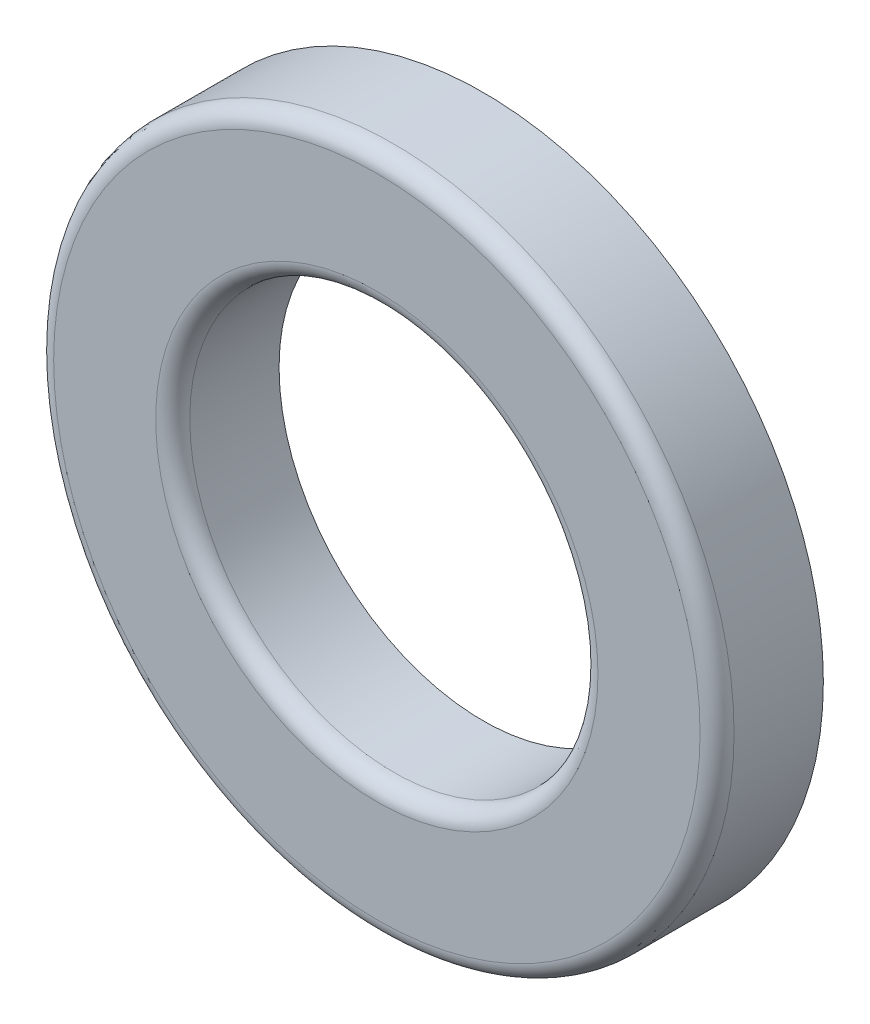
ISO-10303-21;
HEADER;
FILE_DESCRIPTION(('STEP AP214'),'2;1');
FILE_NAME('part.step','',(''),(''),'','','');
FILE_SCHEMA(('AUTOMOTIVE_DESIGN { 1 0 10303 214 1 1 1 1 }'));
ENDSEC;
DATA;
#1=APPLICATION_CONTEXT('core data for automotive mechanical design processes');
#2=APPLICATION_PROTOCOL_DEFINITION('international standard','automotive_design',2000,#1);
#3=PRODUCT_CONTEXT('',#1,'mechanical');
#4=PRODUCT('Part','Part','',(#3));
#5=PRODUCT_RELATED_PRODUCT_CATEGORY('part','',(#4));
#6=PRODUCT_DEFINITION_FORMATION('','',#4);
#7=PRODUCT_DEFINITION_CONTEXT('part definition',#1,'design');
#8=PRODUCT_DEFINITION('design','',#6,#7);
#9=PRODUCT_DEFINITION_SHAPE('','',#8);
#10=(LENGTH_UNIT() NAMED_UNIT(*) SI_UNIT(.MILLI.,.METRE.));
#11=(NAMED_UNIT(*) PLANE_ANGLE_UNIT() SI_UNIT($,.RADIAN.));
#12=(NAMED_UNIT(*) SI_UNIT($,.STERADIAN.) SOLID_ANGLE_UNIT());
#13=UNCERTAINTY_MEASURE_WITH_UNIT(LENGTH_MEASURE(1.E-05),#10,'distance_accuracy_value','');
#14=(GEOMETRIC_REPRESENTATION_CONTEXT(3) GLOBAL_UNCERTAINTY_ASSIGNED_CONTEXT((#13)) GLOBAL_UNIT_ASSIGNED_CONTEXT((#10,
#11,#12)) REPRESENTATION_CONTEXT('',''));
#15=CARTESIAN_POINT('',(0.,0.,0.));
#16=DIRECTION('',(0.,0.,1.));
#17=DIRECTION('',(1.,0.,0.));
#18=AXIS2_PLACEMENT_3D('',#15,#16,#17);
#19=CARTESIAN_POINT('',(0.,0.,0.79375));
#20=DIRECTION('',(0.,0.,1.));
#21=DIRECTION('',(1.,0.,0.));
#22=AXIS2_PLACEMENT_3D('',#19,#20,#21);
#23=PLANE('',#22);
#24=CARTESIAN_POINT('',(0.,0.,0.79375));
#25=DIRECTION('',(0.,0.,1.));
#26=DIRECTION('',(1.,0.,0.));
#27=AXIS2_PLACEMENT_3D('',#24,#25,#26);
#28=CIRCLE('',#27,1.651);
#29=CARTESIAN_POINT('',(1.651,0.,0.79375));
#30=VERTEX_POINT('',#29);
#31=EDGE_CURVE('E36',#30,#30,#28,.F.);
#32=ORIENTED_EDGE('',*,*,#31,.T.);
#33=EDGE_LOOP('',(#32));
#34=FACE_BOUND('',#33,.T.);
#35=CARTESIAN_POINT('',(0.,0.,0.79375));
#36=DIRECTION('',(0.,0.,1.));
#37=DIRECTION('',(1.,0.,0.));
#38=AXIS2_PLACEMENT_3D('',#35,#36,#37);
#39=CIRCLE('',#38,2.413);
#40=CARTESIAN_POINT('',(2.413,0.,0.79375));
#41=VERTEX_POINT('',#40);
#42=EDGE_CURVE('E40',#41,#41,#39,.T.);
#43=ORIENTED_EDGE('',*,*,#42,.T.);
#44=EDGE_LOOP('',(#43));
#45=FACE_BOUND('',#44,.T.);
#46=ADVANCED_FACE('F29',(#34,#45),#23,.T.);
#47=CARTESIAN_POINT('',(0.,0.,0.));
#48=DIRECTION('',(0.,0.,1.));
#49=DIRECTION('',(1.,0.,0.));
#50=AXIS2_PLACEMENT_3D('',#47,#48,#49);
#51=PLANE('',#50);
#52=CARTESIAN_POINT('',(0.,0.,0.));
#53=DIRECTION('',(0.,0.,1.));
#54=DIRECTION('',(1.,0.,0.));
#55=AXIS2_PLACEMENT_3D('',#52,#53,#54);
#56=CIRCLE('',#55,2.54);
#57=CARTESIAN_POINT('',(2.54,0.,0.));
#58=VERTEX_POINT('',#57);
#59=EDGE_CURVE('E49',#58,#58,#56,.T.);
#60=ORIENTED_EDGE('',*,*,#59,.F.);
#61=EDGE_LOOP('',(#60));
#62=FACE_BOUND('',#61,.T.);
#63=CARTESIAN_POINT('',(0.,0.,0.));
#64=DIRECTION('',(0.,0.,1.));
#65=DIRECTION('',(1.,0.,0.));
#66=AXIS2_PLACEMENT_3D('',#63,#64,#65);
#67=CIRCLE('',#66,1.524);
#68=CARTESIAN_POINT('',(1.524,0.,0.));
#69=VERTEX_POINT('',#68);
#70=EDGE_CURVE('E52',#69,#69,#67,.T.);
#71=ORIENTED_EDGE('',*,*,#70,.T.);
#72=EDGE_LOOP('',(#71));
#73=FACE_BOUND('',#72,.T.);
#74=ADVANCED_FACE('F56',(#62,#73),#51,.F.);
#75=CARTESIAN_POINT('',(0.,0.,0.79375));
#76=DIRECTION('',(0.,0.,-1.));
#77=DIRECTION('',(-1.,0.,0.));
#78=AXIS2_PLACEMENT_3D('',#75,#76,#77);
#79=CYLINDRICAL_SURFACE('',#78,2.54);
#80=CARTESIAN_POINT('',(0.,0.,0.66675));
#81=DIRECTION('',(0.,0.,1.));
#82=DIRECTION('',(1.,0.,0.));
#83=AXIS2_PLACEMENT_3D('',#80,#81,#82);
#84=CIRCLE('',#83,2.54);
#85=CARTESIAN_POINT('',(2.54,0.,0.66675));
#86=VERTEX_POINT('',#85);
#87=EDGE_CURVE('E10',#86,#86,#84,.F.);
#88=ORIENTED_EDGE('',*,*,#87,.T.);
#89=EDGE_LOOP('',(#88));
#90=FACE_BOUND('',#89,.T.);
#91=ORIENTED_EDGE('',*,*,#59,.T.);
#92=EDGE_LOOP('',(#91));
#93=FACE_BOUND('',#92,.T.);
#94=ADVANCED_FACE('F31',(#90,#93),#79,.T.);
#95=CARTESIAN_POINT('',(0.,0.,0.79375));
#96=DIRECTION('',(0.,0.,-1.));
#97=DIRECTION('',(-1.,0.,0.));
#98=AXIS2_PLACEMENT_3D('',#95,#96,#97);
#99=CYLINDRICAL_SURFACE('',#98,1.524);
#100=CARTESIAN_POINT('',(0.,0.,0.66675));
#101=DIRECTION('',(0.,0.,1.));
#102=DIRECTION('',(1.,0.,0.));
#103=AXIS2_PLACEMENT_3D('',#100,#101,#102);
#104=CIRCLE('',#103,1.524);
#105=CARTESIAN_POINT('',(1.524,0.,0.66675));
#106=VERTEX_POINT('',#105);
#107=EDGE_CURVE('E44',#106,#106,#104,.T.);
#108=ORIENTED_EDGE('',*,*,#107,.T.);
#109=EDGE_LOOP('',(#108));
#110=FACE_BOUND('',#109,.T.);
#111=ORIENTED_EDGE('',*,*,#70,.F.);
#112=EDGE_LOOP('',(#111));
#113=FACE_BOUND('',#112,.T.);
#114=ADVANCED_FACE('F58',(#110,#113),#99,.F.);
#115=CARTESIAN_POINT('',(0.,0.,0.66675));
#116=DIRECTION('',(0.,0.,1.));
#117=DIRECTION('',(1.,0.,0.));
#118=AXIS2_PLACEMENT_3D('',#115,#116,#117);
#119=TOROIDAL_SURFACE('',#118,1.651,0.127);
#120=ORIENTED_EDGE('',*,*,#31,.F.);
#121=EDGE_LOOP('',(#120));
#122=FACE_BOUND('',#121,.T.);
#123=ORIENTED_EDGE('',*,*,#107,.F.);
#124=EDGE_LOOP('',(#123));
#125=FACE_BOUND('',#124,.T.);
#126=ADVANCED_FACE('F60',(#122,#125),#119,.T.);
#127=CARTESIAN_POINT('',(0.,0.,0.66675));
#128=DIRECTION('',(0.,0.,1.));
#129=DIRECTION('',(1.,0.,0.));
#130=AXIS2_PLACEMENT_3D('',#127,#128,#129);
#131=TOROIDAL_SURFACE('',#130,2.413,0.127);
#132=ORIENTED_EDGE('',*,*,#87,.F.);
#133=EDGE_LOOP('',(#132));
#134=FACE_BOUND('',#133,.T.);
#135=ORIENTED_EDGE('',*,*,#42,.F.);
#136=EDGE_LOOP('',(#135));
#137=FACE_BOUND('',#136,.T.);
#138=ADVANCED_FACE('F67',(#134,#137),#131,.T.);
#139=CLOSED_SHELL('',(#46,#74,#94,#114,#126,#138));
#140=MANIFOLD_SOLID_BREP('B2',#139);
#141=ADVANCED_BREP_SHAPE_REPRESENTATION('',(#18,#140),#14);
#142=SHAPE_DEFINITION_REPRESENTATION(#9,#141);
ENDSEC;
END-ISO-10303-21;
